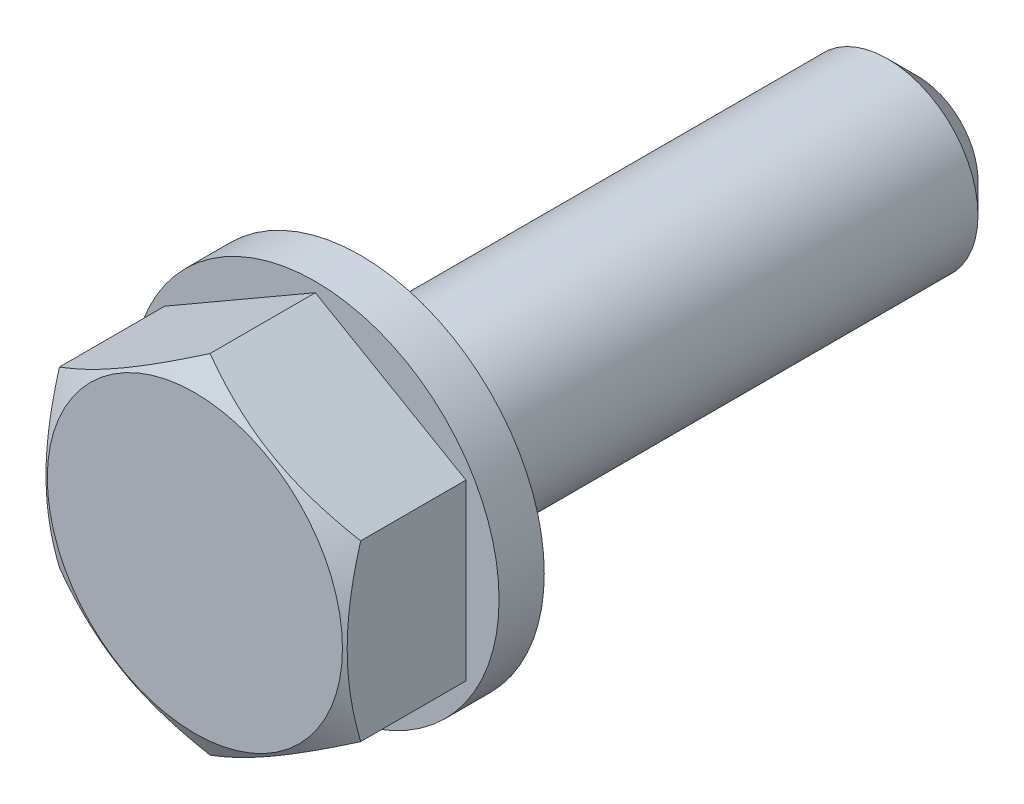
ISO-10303-21;
HEADER;
FILE_DESCRIPTION(('STEP AP214'),'2;1');
FILE_NAME('part.step','',(''),(''),'','','');
FILE_SCHEMA(('AUTOMOTIVE_DESIGN { 1 0 10303 214 1 1 1 1 }'));
ENDSEC;
DATA;
#1=APPLICATION_CONTEXT('core data for automotive mechanical design processes');
#2=APPLICATION_PROTOCOL_DEFINITION('international standard','automotive_design',2000,#1);
#3=PRODUCT_CONTEXT('',#1,'mechanical');
#4=PRODUCT('Part','Part','',(#3));
#5=PRODUCT_RELATED_PRODUCT_CATEGORY('part','',(#4));
#6=PRODUCT_DEFINITION_FORMATION('','',#4);
#7=PRODUCT_DEFINITION_CONTEXT('part definition',#1,'design');
#8=PRODUCT_DEFINITION('design','',#6,#7);
#9=PRODUCT_DEFINITION_SHAPE('','',#8);
#10=(LENGTH_UNIT() NAMED_UNIT(*) SI_UNIT(.MILLI.,.METRE.));
#11=(NAMED_UNIT(*) PLANE_ANGLE_UNIT() SI_UNIT($,.RADIAN.));
#12=(NAMED_UNIT(*) SI_UNIT($,.STERADIAN.) SOLID_ANGLE_UNIT());
#13=UNCERTAINTY_MEASURE_WITH_UNIT(LENGTH_MEASURE(1.E-05),#10,'distance_accuracy_value','');
#14=(GEOMETRIC_REPRESENTATION_CONTEXT(3) GLOBAL_UNCERTAINTY_ASSIGNED_CONTEXT((#13)) GLOBAL_UNIT_ASSIGNED_CONTEXT((#10,
#11,#12)) REPRESENTATION_CONTEXT('',''));
#15=CARTESIAN_POINT('',(0.,0.,0.));
#16=DIRECTION('',(0.,0.,1.));
#17=DIRECTION('',(1.,0.,0.));
#18=AXIS2_PLACEMENT_3D('',#15,#16,#17);
#19=CARTESIAN_POINT('',(0.,5.77350269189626,0.));
#20=DIRECTION('',(0.,0.,1.));
#21=DIRECTION('',(1.,0.,0.));
#22=AXIS2_PLACEMENT_3D('',#19,#20,#21);
#23=PLANE('',#22);
#24=CARTESIAN_POINT('',(0.,0.,0.));
#25=DIRECTION('',(0.,0.,-1.));
#26=DIRECTION('',(-1.,0.,0.));
#27=AXIS2_PLACEMENT_3D('',#24,#25,#26);
#28=CIRCLE('',#27,3.05);
#29=CARTESIAN_POINT('',(-3.05,0.,0.));
#30=VERTEX_POINT('',#29);
#31=EDGE_CURVE('E338',#30,#30,#28,.T.);
#32=ORIENTED_EDGE('',*,*,#31,.T.);
#33=EDGE_LOOP('',(#32));
#34=FACE_BOUND('',#33,.T.);
#35=CARTESIAN_POINT('',(0.,0.,0.));
#36=DIRECTION('',(0.,0.,1.));
#37=DIRECTION('',(1.,0.,0.));
#38=AXIS2_PLACEMENT_3D('',#35,#36,#37);
#39=CIRCLE('',#38,3.);
#40=CARTESIAN_POINT('',(3.,0.,0.));
#41=VERTEX_POINT('',#40);
#42=EDGE_CURVE('E102',#41,#41,#39,.F.);
#43=ORIENTED_EDGE('',*,*,#42,.F.);
#44=EDGE_LOOP('',(#43));
#45=FACE_BOUND('',#44,.T.);
#46=ADVANCED_FACE('F14',(#34,#45),#23,.F.);
#47=CARTESIAN_POINT('',(0.,0.,-20.));
#48=DIRECTION('',(0.,0.,1.));
#49=DIRECTION('',(1.,0.,0.));
#50=AXIS2_PLACEMENT_3D('',#47,#48,#49);
#51=CYLINDRICAL_SURFACE('',#50,3.);
#52=CARTESIAN_POINT('',(0.,0.,-19.));
#53=DIRECTION('',(0.,0.,-1.));
#54=DIRECTION('',(-1.,0.,0.));
#55=AXIS2_PLACEMENT_3D('',#52,#53,#54);
#56=CIRCLE('',#55,3.);
#57=CARTESIAN_POINT('',(-3.,0.,-19.));
#58=VERTEX_POINT('',#57);
#59=EDGE_CURVE('E9',#58,#58,#56,.F.);
#60=ORIENTED_EDGE('',*,*,#59,.T.);
#61=EDGE_LOOP('',(#60));
#62=FACE_BOUND('',#61,.T.);
#63=ORIENTED_EDGE('',*,*,#42,.T.);
#64=EDGE_LOOP('',(#63));
#65=FACE_BOUND('',#64,.T.);
#66=ADVANCED_FACE('F120',(#62,#65),#51,.T.);
#67=CARTESIAN_POINT('',(0.,0.,-20.));
#68=DIRECTION('',(0.,0.,-1.));
#69=DIRECTION('',(-1.,0.,0.));
#70=AXIS2_PLACEMENT_3D('',#67,#68,#69);
#71=PLANE('',#70);
#72=CARTESIAN_POINT('',(0.,0.,-20.));
#73=DIRECTION('',(0.,0.,-1.));
#74=DIRECTION('',(-1.,0.,0.));
#75=AXIS2_PLACEMENT_3D('',#72,#73,#74);
#76=CIRCLE('',#75,2.);
#77=CARTESIAN_POINT('',(-2.,0.,-20.));
#78=VERTEX_POINT('',#77);
#79=EDGE_CURVE('E22',#78,#78,#76,.T.);
#80=ORIENTED_EDGE('',*,*,#79,.T.);
#81=EDGE_LOOP('',(#80));
#82=FACE_BOUND('',#81,.T.);
#83=ADVANCED_FACE('F107',(#82),#71,.T.);
#84=CARTESIAN_POINT('',(0.,0.,-20.));
#85=DIRECTION('',(0.,0.,1.));
#86=DIRECTION('',(1.,0.,0.));
#87=AXIS2_PLACEMENT_3D('',#84,#85,#86);
#88=CONICAL_SURFACE('',#87,2.,0.785398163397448);
#89=ORIENTED_EDGE('',*,*,#59,.F.);
#90=EDGE_LOOP('',(#89));
#91=FACE_BOUND('',#90,.T.);
#92=ORIENTED_EDGE('',*,*,#79,.F.);
#93=EDGE_LOOP('',(#92));
#94=FACE_BOUND('',#93,.T.);
#95=ADVANCED_FACE('F16',(#91,#94),#88,.T.);
#96=CARTESIAN_POINT('',(0.,0.,0.));
#97=DIRECTION('',(0.,0.,-1.));
#98=DIRECTION('',(-1.,0.,0.));
#99=AXIS2_PLACEMENT_3D('',#96,#97,#98);
#100=PLANE('',#99);
#101=CARTESIAN_POINT('',(0.,0.,0.));
#102=DIRECTION('',(0.,0.,-1.));
#103=DIRECTION('',(-1.,0.,0.));
#104=AXIS2_PLACEMENT_3D('',#101,#102,#103);
#105=CIRCLE('',#104,6.1);
#106=CARTESIAN_POINT('',(-6.1,0.,0.));
#107=VERTEX_POINT('',#106);
#108=EDGE_CURVE('E337',#107,#107,#105,.T.);
#109=ORIENTED_EDGE('',*,*,#108,.F.);
#110=EDGE_LOOP('',(#109));
#111=FACE_BOUND('',#110,.T.);
#112=DIRECTION('',(-0.866025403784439,-0.5,0.));
#113=VECTOR('',#112,1.);
#114=CARTESIAN_POINT('',(0.,5.77350269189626,0.));
#115=LINE('',#114,#113);
#116=CARTESIAN_POINT('',(0.,5.77350269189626,0.));
#117=VERTEX_POINT('',#116);
#118=CARTESIAN_POINT('',(-5.,2.88675134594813,0.));
#119=VERTEX_POINT('',#118);
#120=EDGE_CURVE('E210',#117,#119,#115,.T.);
#121=ORIENTED_EDGE('',*,*,#120,.F.);
#122=DIRECTION('',(-0.866025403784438,0.5,0.));
#123=VECTOR('',#122,1.);
#124=CARTESIAN_POINT('',(5.,2.88675134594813,0.));
#125=LINE('',#124,#123);
#126=CARTESIAN_POINT('',(5.,2.88675134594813,0.));
#127=VERTEX_POINT('',#126);
#128=EDGE_CURVE('E37',#127,#117,#125,.T.);
#129=ORIENTED_EDGE('',*,*,#128,.F.);
#130=DIRECTION('',(0.,1.,0.));
#131=VECTOR('',#130,1.);
#132=CARTESIAN_POINT('',(5.,-2.88675134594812,0.));
#133=LINE('',#132,#131);
#134=CARTESIAN_POINT('',(5.,-2.88675134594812,0.));
#135=VERTEX_POINT('',#134);
#136=EDGE_CURVE('E65',#135,#127,#133,.T.);
#137=ORIENTED_EDGE('',*,*,#136,.F.);
#138=DIRECTION('',(0.866025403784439,0.5,0.));
#139=VECTOR('',#138,1.);
#140=CARTESIAN_POINT('',(0.,-5.77350269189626,0.));
#141=LINE('',#140,#139);
#142=CARTESIAN_POINT('',(0.,-5.77350269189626,0.));
#143=VERTEX_POINT('',#142);
#144=EDGE_CURVE('E69',#143,#135,#141,.T.);
#145=ORIENTED_EDGE('',*,*,#144,.F.);
#146=DIRECTION('',(0.866025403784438,-0.5,0.));
#147=VECTOR('',#146,1.);
#148=CARTESIAN_POINT('',(-5.,-2.88675134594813,0.));
#149=LINE('',#148,#147);
#150=CARTESIAN_POINT('',(-5.,-2.88675134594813,0.));
#151=VERTEX_POINT('',#150);
#152=EDGE_CURVE('E85',#151,#143,#149,.T.);
#153=ORIENTED_EDGE('',*,*,#152,.F.);
#154=DIRECTION('',(0.,-1.,0.));
#155=VECTOR('',#154,1.);
#156=CARTESIAN_POINT('',(-5.,2.88675134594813,0.));
#157=LINE('',#156,#155);
#158=EDGE_CURVE('E87',#119,#151,#157,.T.);
#159=ORIENTED_EDGE('',*,*,#158,.F.);
#160=EDGE_LOOP('',(#121,#129,#137,#145,#153,#159));
#161=FACE_BOUND('',#160,.T.);
#162=ADVANCED_FACE('F67',(#111,#161),#100,.F.);
#163=CARTESIAN_POINT('',(0.,0.,-1.5));
#164=DIRECTION('',(0.,0.,-1.));
#165=DIRECTION('',(-1.,0.,0.));
#166=AXIS2_PLACEMENT_3D('',#163,#164,#165);
#167=PLANE('',#166);
#168=CARTESIAN_POINT('',(0.,0.,-1.5));
#169=DIRECTION('',(0.,0.,-1.));
#170=DIRECTION('',(-1.,0.,0.));
#171=AXIS2_PLACEMENT_3D('',#168,#169,#170);
#172=CIRCLE('',#171,6.1);
#173=CARTESIAN_POINT('',(-6.1,0.,-1.5));
#174=VERTEX_POINT('',#173);
#175=EDGE_CURVE('E333',#174,#174,#172,.T.);
#176=ORIENTED_EDGE('',*,*,#175,.T.);
#177=EDGE_LOOP('',(#176));
#178=FACE_BOUND('',#177,.T.);
#179=CARTESIAN_POINT('',(0.,0.,-1.5));
#180=DIRECTION('',(0.,0.,-1.));
#181=DIRECTION('',(-1.,0.,0.));
#182=AXIS2_PLACEMENT_3D('',#179,#180,#181);
#183=CIRCLE('',#182,3.05);
#184=CARTESIAN_POINT('',(-3.05,0.,-1.5));
#185=VERTEX_POINT('',#184);
#186=EDGE_CURVE('E336',#185,#185,#183,.T.);
#187=ORIENTED_EDGE('',*,*,#186,.F.);
#188=EDGE_LOOP('',(#187));
#189=FACE_BOUND('',#188,.T.);
#190=ADVANCED_FACE('F117',(#178,#189),#167,.T.);
#191=CARTESIAN_POINT('',(0.,0.,-1.5));
#192=DIRECTION('',(0.,0.,1.));
#193=DIRECTION('',(1.,0.,0.));
#194=AXIS2_PLACEMENT_3D('',#191,#192,#193);
#195=CYLINDRICAL_SURFACE('',#194,6.1);
#196=ORIENTED_EDGE('',*,*,#175,.F.);
#197=EDGE_LOOP('',(#196));
#198=FACE_BOUND('',#197,.T.);
#199=ORIENTED_EDGE('',*,*,#108,.T.);
#200=EDGE_LOOP('',(#199));
#201=FACE_BOUND('',#200,.T.);
#202=ADVANCED_FACE('F260',(#198,#201),#195,.T.);
#203=CARTESIAN_POINT('',(0.,0.,-1.5));
#204=DIRECTION('',(0.,0.,1.));
#205=DIRECTION('',(1.,0.,0.));
#206=AXIS2_PLACEMENT_3D('',#203,#204,#205);
#207=CYLINDRICAL_SURFACE('',#206,3.05);
#208=ORIENTED_EDGE('',*,*,#186,.T.);
#209=EDGE_LOOP('',(#208));
#210=FACE_BOUND('',#209,.T.);
#211=ORIENTED_EDGE('',*,*,#31,.F.);
#212=EDGE_LOOP('',(#211));
#213=FACE_BOUND('',#212,.T.);
#214=ADVANCED_FACE('F252',(#210,#213),#207,.F.);
#215=CARTESIAN_POINT('',(0.,5.77350269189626,4.));
#216=DIRECTION('',(0.,0.,1.));
#217=DIRECTION('',(1.,0.,0.));
#218=AXIS2_PLACEMENT_3D('',#215,#216,#217);
#219=PLANE('',#218);
#220=CARTESIAN_POINT('',(0.,0.,4.));
#221=DIRECTION('',(0.,0.,-1.));
#222=DIRECTION('',(-1.,0.,0.));
#223=AXIS2_PLACEMENT_3D('',#220,#221,#222);
#224=CIRCLE('',#223,4.9);
#225=CARTESIAN_POINT('',(-4.9,0.,4.));
#226=VERTEX_POINT('',#225);
#227=EDGE_CURVE('E151',#226,#226,#224,.T.);
#228=ORIENTED_EDGE('',*,*,#227,.F.);
#229=EDGE_LOOP('',(#228));
#230=FACE_BOUND('',#229,.T.);
#231=ADVANCED_FACE('F136',(#230),#219,.T.);
#232=CARTESIAN_POINT('',(0.,0.,4.));
#233=DIRECTION('',(0.,0.,-1.));
#234=DIRECTION('',(-1.,0.,0.));
#235=AXIS2_PLACEMENT_3D('',#232,#233,#234);
#236=CONICAL_SURFACE('',#235,4.9,1.0471975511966);
#237=ORIENTED_EDGE('',*,*,#227,.T.);
#238=EDGE_LOOP('',(#237));
#239=FACE_BOUND('',#238,.T.);
#240=CARTESIAN_POINT('',(-5.0002,2.88663587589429,3.49561631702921));
#241=CARTESIAN_POINT('',(-4.78046540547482,3.01349970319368,3.5688784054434));
#242=CARTESIAN_POINT('',(-4.55885141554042,3.14144859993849,3.63551365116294));
#243=CARTESIAN_POINT('',(-4.11178600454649,3.39956193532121,3.75182598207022));
#244=CARTESIAN_POINT('',(-3.88632664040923,3.52973095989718,3.80146192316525));
#245=CARTESIAN_POINT('',(-3.43816769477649,3.78847564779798,3.87871394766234));
#246=CARTESIAN_POINT('',(-3.21553790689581,3.91701101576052,3.90684459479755));
#247=CARTESIAN_POINT('',(-2.88081009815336,4.11026620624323,3.93207005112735));
#248=CARTESIAN_POINT('',(-2.76915780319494,4.17472868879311,3.93765151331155));
#249=CARTESIAN_POINT('',(-2.54575002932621,4.30371322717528,3.94306275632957));
#250=CARTESIAN_POINT('',(-2.43399455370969,4.36823528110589,3.94289271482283));
#251=CARTESIAN_POINT('',(-2.12781576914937,4.54500768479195,3.934511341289));
#252=CARTESIAN_POINT('',(-1.93349391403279,4.65719946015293,3.92043520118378));
#253=CARTESIAN_POINT('',(-1.5461398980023,4.88083840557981,3.8757997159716));
#254=CARTESIAN_POINT('',(-1.35310909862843,4.9922847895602,3.84522511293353));
#255=CARTESIAN_POINT('',(-0.96497465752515,5.21637431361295,3.76879647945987));
#256=CARTESIAN_POINT('',(-0.769920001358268,5.32898917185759,3.72261859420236));
#257=CARTESIAN_POINT('',(-0.382719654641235,5.55253939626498,3.6178131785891));
#258=CARTESIAN_POINT('',(-0.190569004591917,5.66347762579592,3.55921026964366));
#259=CARTESIAN_POINT('',(0.000199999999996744,5.7736181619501,3.49561631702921));
#260=B_SPLINE_CURVE_WITH_KNOTS('',3,(#240,#241,#242,#243,#244,#245,#246,#247,#248,#249,#250,
#251,#252,#253,#254,#255,#256,#257,#258,#259),.UNSPECIFIED.,.F.,.F.,(4,2,2,2,2,2,2,2,2,4),(0.,
0.792555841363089,1.58701660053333,2.3618153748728,2.74884076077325,3.13585419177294,
3.80962362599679,4.48401723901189,5.17336882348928,5.86136694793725),.UNSPECIFIED.);
#261=CARTESIAN_POINT('',(-5.,2.88675134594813,3.49568298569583));
#262=VERTEX_POINT('',#261);
#263=CARTESIAN_POINT('',(0.,5.77350269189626,3.49568298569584));
#264=VERTEX_POINT('',#263);
#265=EDGE_CURVE('E180',#262,#264,#260,.T.);
#266=ORIENTED_EDGE('',*,*,#265,.F.);
#267=CARTESIAN_POINT('',(-5.,-7.710520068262,1.52329237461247));
#268=CARTESIAN_POINT('',(-5.,-7.49250008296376,1.62887535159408));
#269=CARTESIAN_POINT('',(-5.,-7.27397489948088,1.73343324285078));
#270=CARTESIAN_POINT('',(-5.,-6.83564530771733,1.93992142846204));
#271=CARTESIAN_POINT('',(-5.,-6.61584070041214,2.04185129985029));
#272=CARTESIAN_POINT('',(-5.,-6.17352983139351,2.24302821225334));
#273=CARTESIAN_POINT('',(-5.,-5.95101534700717,2.3422572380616));
#274=CARTESIAN_POINT('',(-5.,-5.50420121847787,2.5365957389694));
#275=CARTESIAN_POINT('',(-5.,-5.27990166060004,2.63170541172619));
#276=CARTESIAN_POINT('',(-5.,-4.82208977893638,2.81961847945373));
#277=CARTESIAN_POINT('',(-5.,-4.58850905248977,2.91225614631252));
#278=CARTESIAN_POINT('',(-5.,-4.11859872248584,3.09041397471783));
#279=CARTESIAN_POINT('',(-5.,-3.8822688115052,3.17593333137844));
#280=CARTESIAN_POINT('',(-5.,-3.40694086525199,3.3375774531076));
#281=CARTESIAN_POINT('',(-5.,-3.1679494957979,3.41372162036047));
#282=CARTESIAN_POINT('',(-5.,-2.68653906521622,3.55414319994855));
#283=CARTESIAN_POINT('',(-5.,-2.44412112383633,3.61842439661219));
#284=CARTESIAN_POINT('',(-5.,-1.95705791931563,3.73166682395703));
#285=CARTESIAN_POINT('',(-5.,-1.71243195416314,3.78070951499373));
#286=CARTESIAN_POINT('',(-5.,-1.22018417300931,3.86067296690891));
#287=CARTESIAN_POINT('',(-5.,-0.97256262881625,3.89159535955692));
#288=CARTESIAN_POINT('',(-5.,-0.478776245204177,3.93244571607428));
#289=CARTESIAN_POINT('',(-5.,-0.232634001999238,3.9426401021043));
#290=CARTESIAN_POINT('',(-5.,0.259635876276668,3.9418687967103));
#291=CARTESIAN_POINT('',(-5.,0.505763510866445,3.93090260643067));
#292=CARTESIAN_POINT('',(-5.,0.924924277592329,3.89497733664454));
#293=CARTESIAN_POINT('',(-5.,1.09841032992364,3.8750116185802));
#294=CARTESIAN_POINT('',(-5.,1.44407602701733,3.8258338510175));
#295=CARTESIAN_POINT('',(-5.,1.61625548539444,3.79662050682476));
#296=CARTESIAN_POINT('',(-5.,2.13062542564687,3.69664838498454));
#297=CARTESIAN_POINT('',(-5.,2.47044753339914,3.61357689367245));
#298=CARTESIAN_POINT('',(-5.,2.97851264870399,3.46999451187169));
#299=CARTESIAN_POINT('',(-5.,3.14940098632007,3.41831498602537));
#300=CARTESIAN_POINT('',(-5.,3.48951680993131,3.30970491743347));
#301=CARTESIAN_POINT('',(-5.,3.65874428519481,3.25277434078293));
#302=CARTESIAN_POINT('',(-5.,3.99559425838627,3.13456602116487));
#303=CARTESIAN_POINT('',(-5.,4.16321729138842,3.07328978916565));
#304=CARTESIAN_POINT('',(-5.,4.4970825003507,2.94709939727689));
#305=CARTESIAN_POINT('',(-5.,4.66332469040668,2.88218527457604));
#306=CARTESIAN_POINT('',(-5.,5.0468902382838,2.72834580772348));
#307=CARTESIAN_POINT('',(-5.,5.2637677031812,2.63831096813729));
#308=CARTESIAN_POINT('',(-5.,5.69574960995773,2.45407283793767));
#309=CARTESIAN_POINT('',(-5.,5.91085395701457,2.35986932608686));
#310=CARTESIAN_POINT('',(-5.,6.33960523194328,2.16810763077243));
#311=CARTESIAN_POINT('',(-5.,6.55325188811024,2.07054884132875));
#312=CARTESIAN_POINT('',(-5.,6.97928985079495,1.87272379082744));
#313=CARTESIAN_POINT('',(-5.,7.19168113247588,1.77245747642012));
#314=CARTESIAN_POINT('',(-5.,7.82766492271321,1.4681803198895));
#315=CARTESIAN_POINT('',(-5.,8.24967706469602,1.26086815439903));
#316=CARTESIAN_POINT('',(-5.,9.09069164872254,0.840227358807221));
#317=CARTESIAN_POINT('',(-5.,9.50969398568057,0.626898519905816));
#318=CARTESIAN_POINT('',(-5.,10.1197143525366,0.312339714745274));
#319=CARTESIAN_POINT('',(-5.,10.3116116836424,0.21280999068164));
#320=CARTESIAN_POINT('',(-5.,10.6949886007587,0.0129573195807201));
#321=CARTESIAN_POINT('',(-5.,10.886468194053,-0.0873656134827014));
#322=CARTESIAN_POINT('',(-5.,11.4603788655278,-0.389373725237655));
#323=CARTESIAN_POINT('',(-5.,11.8422670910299,-0.592090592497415));
#324=CARTESIAN_POINT('',(-5.,12.6040312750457,-0.999155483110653));
#325=CARTESIAN_POINT('',(-5.,12.9839098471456,-1.20349862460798));
#326=CARTESIAN_POINT('',(-5.,13.7427444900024,-1.61384482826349));
#327=CARTESIAN_POINT('',(-5.,14.1217006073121,-1.81984780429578));
#328=CARTESIAN_POINT('',(-5.,14.5003145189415,-2.02647390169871));
#329=B_SPLINE_CURVE_WITH_KNOTS('',3,(#267,#268,#269,#270,#271,#272,#273,#274,#275,#276,#277,
#278,#279,#280,#281,#282,#283,#284,#285,#286,#287,#288,#289,#290,#291,#292,#293,#294,#295,#296,
#297,#298,#299,#300,#301,#302,#303,#304,#305,#306,#307,#308,#309,#310,#311,#312,#313,#314,#315,
#316,#317,#318,#319,#320,#321,#322,#323,#324,#325,#326,#327,#328),.UNSPECIFIED.,.F.,.F.,(4,2,2,
2,2,2,2,2,2,2,2,2,2,2,2,2,2,2,2,2,2,2,2,2,2,2,2,2,2,2,4),(0.,0.726730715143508,1.45357767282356,
2.18445592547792,2.91529906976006,3.66904976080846,4.42288556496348,5.17513408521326,
5.92714221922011,6.67505829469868,7.42290700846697,8.16108107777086,8.89927254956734,
9.4229111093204,9.94662301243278,10.9946467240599,11.5301982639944,12.0657532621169,
12.6011229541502,13.1364871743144,13.840900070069,14.545350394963,15.2499286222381,
15.9545207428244,17.3649902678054,18.7755088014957,19.4240261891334,20.0725321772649,
21.3695939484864,22.6636432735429,23.9576258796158),.UNSPECIFIED.);
#330=CARTESIAN_POINT('',(-5.,-2.88675134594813,3.49568298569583));
#331=VERTEX_POINT('',#330);
#332=EDGE_CURVE('E173',#331,#262,#329,.T.);
#333=ORIENTED_EDGE('',*,*,#332,.F.);
#334=CARTESIAN_POINT('',(0.000199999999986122,-5.7736181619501,3.49561631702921));
#335=CARTESIAN_POINT('',(-0.219534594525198,-5.64675433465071,3.56887840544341));
#336=CARTESIAN_POINT('',(-0.441148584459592,-5.51880543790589,3.63551365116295));
#337=CARTESIAN_POINT('',(-0.888213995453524,-5.26069210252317,3.75182598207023));
#338=CARTESIAN_POINT('',(-1.11367335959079,-5.13052307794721,3.80146192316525));
#339=CARTESIAN_POINT('',(-1.56183230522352,-4.87177839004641,3.87871394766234));
#340=CARTESIAN_POINT('',(-1.7844620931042,-4.74324302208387,3.90684459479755));
#341=CARTESIAN_POINT('',(-2.11918990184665,-4.54998783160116,3.93207005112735));
#342=CARTESIAN_POINT('',(-2.23084219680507,-4.48552534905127,3.93765151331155));
#343=CARTESIAN_POINT('',(-2.45424997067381,-4.35654081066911,3.94306275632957));
#344=CARTESIAN_POINT('',(-2.56600544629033,-4.2920187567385,3.94289271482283));
#345=CARTESIAN_POINT('',(-2.87218423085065,-4.11524635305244,3.934511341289));
#346=CARTESIAN_POINT('',(-3.06650608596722,-4.00305457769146,3.92043520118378));
#347=CARTESIAN_POINT('',(-3.45386010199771,-3.77941563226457,3.8757997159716));
#348=CARTESIAN_POINT('',(-3.64689090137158,-3.66796924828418,3.84522511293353));
#349=CARTESIAN_POINT('',(-4.03502534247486,-3.44387972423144,3.76879647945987));
#350=CARTESIAN_POINT('',(-4.23007999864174,-3.3312648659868,3.72261859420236));
#351=CARTESIAN_POINT('',(-4.61728034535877,-3.1077146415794,3.6178131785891));
#352=CARTESIAN_POINT('',(-4.80943099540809,-2.99677641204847,3.55921026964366));
#353=CARTESIAN_POINT('',(-5.0002,-2.88663587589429,3.49561631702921));
#354=B_SPLINE_CURVE_WITH_KNOTS('',3,(#334,#335,#336,#337,#338,#339,#340,#341,#342,#343,#344,
#345,#346,#347,#348,#349,#350,#351,#352,#353),.UNSPECIFIED.,.F.,.F.,(4,2,2,2,2,2,2,2,2,4),(0.,
0.792555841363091,1.58701660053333,2.36181537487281,2.74884076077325,3.13585419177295,
3.80962362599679,4.48401723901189,5.17336882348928,5.86136694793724),.UNSPECIFIED.);
#355=CARTESIAN_POINT('',(0.,-5.77350269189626,3.49568298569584));
#356=VERTEX_POINT('',#355);
#357=EDGE_CURVE('E167',#356,#331,#354,.T.);
#358=ORIENTED_EDGE('',*,*,#357,.F.);
#359=CARTESIAN_POINT('',(5.0002,-2.88663587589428,3.49561631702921));
#360=CARTESIAN_POINT('',(4.78046540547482,-3.01349970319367,3.56887840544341));
#361=CARTESIAN_POINT('',(4.55885141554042,-3.14144859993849,3.63551365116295));
#362=CARTESIAN_POINT('',(4.11178600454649,-3.3995619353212,3.75182598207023));
#363=CARTESIAN_POINT('',(3.88632664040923,-3.52973095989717,3.80146192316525));
#364=CARTESIAN_POINT('',(3.43816769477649,-3.78847564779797,3.87871394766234));
#365=CARTESIAN_POINT('',(3.21553790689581,-3.91701101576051,3.90684459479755));
#366=CARTESIAN_POINT('',(2.88081009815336,-4.11026620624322,3.93207005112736));
#367=CARTESIAN_POINT('',(2.76915780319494,-4.1747286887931,3.93765151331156));
#368=CARTESIAN_POINT('',(2.5457500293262,-4.30371322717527,3.94306275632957));
#369=CARTESIAN_POINT('',(2.43399455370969,-4.36823528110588,3.94289271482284));
#370=CARTESIAN_POINT('',(2.12781576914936,-4.54500768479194,3.93451134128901));
#371=CARTESIAN_POINT('',(1.93349391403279,-4.65719946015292,3.92043520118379));
#372=CARTESIAN_POINT('',(1.54613989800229,-4.88083840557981,3.87579971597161));
#373=CARTESIAN_POINT('',(1.35310909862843,-4.9922847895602,3.84522511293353));
#374=CARTESIAN_POINT('',(0.964974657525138,-5.21637431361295,3.76879647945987));
#375=CARTESIAN_POINT('',(0.769920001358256,-5.32898917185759,3.72261859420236));
#376=CARTESIAN_POINT('',(0.38271965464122,-5.55253939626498,3.6178131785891));
#377=CARTESIAN_POINT('',(0.190569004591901,-5.66347762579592,3.55921026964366));
#378=CARTESIAN_POINT('',(-0.000200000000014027,-5.7736181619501,3.49561631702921));
#379=B_SPLINE_CURVE_WITH_KNOTS('',3,(#359,#360,#361,#362,#363,#364,#365,#366,#367,#368,#369,
#370,#371,#372,#373,#374,#375,#376,#377,#378),.UNSPECIFIED.,.F.,.F.,(4,2,2,2,2,2,2,2,2,4),(0.,
0.79255584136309,1.58701660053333,2.3618153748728,2.74884076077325,3.13585419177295,
3.80962362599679,4.4840172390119,5.1733688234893,5.86136694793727),.UNSPECIFIED.);
#380=CARTESIAN_POINT('',(5.,-2.88675134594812,3.49568298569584));
#381=VERTEX_POINT('',#380);
#382=EDGE_CURVE('E29',#381,#356,#379,.T.);
#383=ORIENTED_EDGE('',*,*,#382,.F.);
#384=CARTESIAN_POINT('',(5.,-7.71052006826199,1.52329237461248));
#385=CARTESIAN_POINT('',(5.,-7.49250008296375,1.62887535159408));
#386=CARTESIAN_POINT('',(5.,-7.27397489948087,1.73343324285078));
#387=CARTESIAN_POINT('',(5.,-6.83564530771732,1.93992142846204));
#388=CARTESIAN_POINT('',(5.,-6.61584070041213,2.0418512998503));
#389=CARTESIAN_POINT('',(5.,-6.1735298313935,2.24302821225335));
#390=CARTESIAN_POINT('',(5.,-5.95101534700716,2.3422572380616));
#391=CARTESIAN_POINT('',(5.,-5.50420121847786,2.5365957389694));
#392=CARTESIAN_POINT('',(5.,-5.27990166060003,2.63170541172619));
#393=CARTESIAN_POINT('',(5.,-4.82208977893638,2.81961847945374));
#394=CARTESIAN_POINT('',(5.,-4.58850905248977,2.91225614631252));
#395=CARTESIAN_POINT('',(5.,-4.11859872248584,3.09041397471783));
#396=CARTESIAN_POINT('',(5.,-3.88226881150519,3.17593333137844));
#397=CARTESIAN_POINT('',(5.,-3.40694086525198,3.3375774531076));
#398=CARTESIAN_POINT('',(5.,-3.16794949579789,3.41372162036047));
#399=CARTESIAN_POINT('',(5.,-2.68653906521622,3.55414319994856));
#400=CARTESIAN_POINT('',(5.,-2.44412112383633,3.61842439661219));
#401=CARTESIAN_POINT('',(5.,-1.95705791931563,3.73166682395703));
#402=CARTESIAN_POINT('',(5.,-1.71243195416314,3.78070951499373));
#403=CARTESIAN_POINT('',(5.,-1.22018417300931,3.86067296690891));
#404=CARTESIAN_POINT('',(5.,-0.972562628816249,3.89159535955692));
#405=CARTESIAN_POINT('',(5.,-0.478776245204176,3.93244571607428));
#406=CARTESIAN_POINT('',(5.,-0.232634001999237,3.9426401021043));
#407=CARTESIAN_POINT('',(5.,0.259635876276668,3.9418687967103));
#408=CARTESIAN_POINT('',(5.,0.505763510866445,3.93090260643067));
#409=CARTESIAN_POINT('',(5.,0.924924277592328,3.89497733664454));
#410=CARTESIAN_POINT('',(5.,1.09841032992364,3.8750116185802));
#411=CARTESIAN_POINT('',(5.,1.44407602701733,3.8258338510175));
#412=CARTESIAN_POINT('',(5.,1.61625548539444,3.79662050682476));
#413=CARTESIAN_POINT('',(5.,2.13062542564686,3.69664838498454));
#414=CARTESIAN_POINT('',(5.,2.47044753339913,3.61357689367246));
#415=CARTESIAN_POINT('',(5.,2.97851264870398,3.46999451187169));
#416=CARTESIAN_POINT('',(5.,3.14940098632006,3.41831498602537));
#417=CARTESIAN_POINT('',(5.,3.4895168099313,3.30970491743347));
#418=CARTESIAN_POINT('',(5.,3.6587442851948,3.25277434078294));
#419=CARTESIAN_POINT('',(5.,3.99559425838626,3.13456602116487));
#420=CARTESIAN_POINT('',(5.,4.16321729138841,3.07328978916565));
#421=CARTESIAN_POINT('',(5.,4.49708250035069,2.94709939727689));
#422=CARTESIAN_POINT('',(5.,4.66332469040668,2.88218527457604));
#423=CARTESIAN_POINT('',(5.,5.04689023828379,2.72834580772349));
#424=CARTESIAN_POINT('',(5.,5.26376770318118,2.6383109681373));
#425=CARTESIAN_POINT('',(5.,5.69574960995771,2.45407283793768));
#426=CARTESIAN_POINT('',(5.,5.91085395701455,2.35986932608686));
#427=CARTESIAN_POINT('',(5.,6.33960523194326,2.16810763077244));
#428=CARTESIAN_POINT('',(5.,6.55325188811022,2.07054884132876));
#429=CARTESIAN_POINT('',(5.,6.97928985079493,1.87272379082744));
#430=CARTESIAN_POINT('',(5.,7.19168113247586,1.77245747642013));
#431=CARTESIAN_POINT('',(5.,7.82766492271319,1.46818031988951));
#432=CARTESIAN_POINT('',(5.,8.249677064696,1.26086815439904));
#433=CARTESIAN_POINT('',(5.,9.09069164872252,0.840227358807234));
#434=CARTESIAN_POINT('',(5.,9.50969398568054,0.626898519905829));
#435=CARTESIAN_POINT('',(5.,10.1197143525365,0.312339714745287));
#436=CARTESIAN_POINT('',(5.,10.3116116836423,0.212809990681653));
#437=CARTESIAN_POINT('',(5.,10.6949886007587,0.0129573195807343));
#438=CARTESIAN_POINT('',(5.,10.8864681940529,-0.0873656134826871));
#439=CARTESIAN_POINT('',(5.,11.4603788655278,-0.389373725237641));
#440=CARTESIAN_POINT('',(5.,11.8422670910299,-0.592090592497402));
#441=CARTESIAN_POINT('',(5.,12.6040312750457,-0.999155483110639));
#442=CARTESIAN_POINT('',(5.,12.9839098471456,-1.20349862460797));
#443=CARTESIAN_POINT('',(5.,13.7427444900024,-1.61384482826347));
#444=CARTESIAN_POINT('',(5.,14.121700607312,-1.81984780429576));
#445=CARTESIAN_POINT('',(5.,14.5003145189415,-2.0264739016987));
#446=B_SPLINE_CURVE_WITH_KNOTS('',3,(#384,#385,#386,#387,#388,#389,#390,#391,#392,#393,#394,
#395,#396,#397,#398,#399,#400,#401,#402,#403,#404,#405,#406,#407,#408,#409,#410,#411,#412,#413,
#414,#415,#416,#417,#418,#419,#420,#421,#422,#423,#424,#425,#426,#427,#428,#429,#430,#431,#432,
#433,#434,#435,#436,#437,#438,#439,#440,#441,#442,#443,#444,#445),.UNSPECIFIED.,.F.,.F.,(4,2,2,
2,2,2,2,2,2,2,2,2,2,2,2,2,2,2,2,2,2,2,2,2,2,2,2,2,2,2,4),(0.,0.726730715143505,1.45357767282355,
2.18445592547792,2.91529906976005,3.66904976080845,4.42288556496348,5.17513408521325,
5.9271422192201,6.67505829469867,7.42290700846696,8.16108107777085,8.89927254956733,
9.42291110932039,9.94662301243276,10.9946467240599,11.5301982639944,12.0657532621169,
12.6011229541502,13.1364871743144,13.840900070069,14.545350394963,15.249928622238,
15.9545207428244,17.3649902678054,18.7755088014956,19.4240261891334,20.0725321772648,
21.3695939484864,22.6636432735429,23.9576258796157),.UNSPECIFIED.);
#447=CARTESIAN_POINT('',(5.,2.88675134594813,3.49568298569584));
#448=VERTEX_POINT('',#447);
#449=EDGE_CURVE('E78',#448,#381,#446,.F.);
#450=ORIENTED_EDGE('',*,*,#449,.F.);
#451=CARTESIAN_POINT('',(-0.000200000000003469,5.7736181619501,3.49561631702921));
#452=CARTESIAN_POINT('',(0.219534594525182,5.64675433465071,3.5688784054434));
#453=CARTESIAN_POINT('',(0.441148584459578,5.5188054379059,3.63551365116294));
#454=CARTESIAN_POINT('',(0.888213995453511,5.26069210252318,3.75182598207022));
#455=CARTESIAN_POINT('',(1.11367335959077,5.13052307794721,3.80146192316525));
#456=CARTESIAN_POINT('',(1.56183230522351,4.87177839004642,3.87871394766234));
#457=CARTESIAN_POINT('',(1.78446209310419,4.74324302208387,3.90684459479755));
#458=CARTESIAN_POINT('',(2.11918990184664,4.54998783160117,3.93207005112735));
#459=CARTESIAN_POINT('',(2.23084219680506,4.48552534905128,3.93765151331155));
#460=CARTESIAN_POINT('',(2.45424997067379,4.35654081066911,3.94306275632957));
#461=CARTESIAN_POINT('',(2.56600544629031,4.2920187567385,3.94289271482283));
#462=CARTESIAN_POINT('',(2.87218423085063,4.11524635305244,3.934511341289));
#463=CARTESIAN_POINT('',(3.06650608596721,4.00305457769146,3.92043520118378));
#464=CARTESIAN_POINT('',(3.4538601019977,3.77941563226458,3.87579971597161));
#465=CARTESIAN_POINT('',(3.64689090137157,3.66796924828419,3.84522511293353));
#466=CARTESIAN_POINT('',(4.03502534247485,3.44387972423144,3.76879647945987));
#467=CARTESIAN_POINT('',(4.23007999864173,3.3312648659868,3.72261859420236));
#468=CARTESIAN_POINT('',(4.61728034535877,3.10771464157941,3.6178131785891));
#469=CARTESIAN_POINT('',(4.80943099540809,2.99677641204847,3.55921026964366));
#470=CARTESIAN_POINT('',(5.0002,2.88663587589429,3.49561631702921));
#471=B_SPLINE_CURVE_WITH_KNOTS('',3,(#451,#452,#453,#454,#455,#456,#457,#458,#459,#460,#461,
#462,#463,#464,#465,#466,#467,#468,#469,#470),.UNSPECIFIED.,.F.,.F.,(4,2,2,2,2,2,2,2,2,4),(0.,
0.79255584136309,1.58701660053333,2.3618153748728,2.74884076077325,3.13585419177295,
3.80962362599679,4.48401723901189,5.17336882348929,5.86136694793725),.UNSPECIFIED.);
#472=EDGE_CURVE('E187',#264,#448,#471,.T.);
#473=ORIENTED_EDGE('',*,*,#472,.F.);
#474=EDGE_LOOP('',(#266,#333,#358,#383,#450,#473));
#475=FACE_BOUND('',#474,.T.);
#476=ADVANCED_FACE('F141',(#239,#475),#236,.T.);
#477=CARTESIAN_POINT('',(5.,-2.88675134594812,4.));
#478=DIRECTION('',(-1.,0.,0.));
#479=DIRECTION('',(0.,0.,1.));
#480=AXIS2_PLACEMENT_3D('',#477,#478,#479);
#481=PLANE('',#480);
#482=DIRECTION('',(0.,0.,-1.));
#483=VECTOR('',#482,1.);
#484=CARTESIAN_POINT('',(5.,2.88675134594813,4.));
#485=LINE('',#484,#483);
#486=EDGE_CURVE('E73',#448,#127,#485,.T.);
#487=ORIENTED_EDGE('',*,*,#486,.F.);
#488=ORIENTED_EDGE('',*,*,#449,.T.);
#489=DIRECTION('',(0.,0.,-1.));
#490=VECTOR('',#489,1.);
#491=CARTESIAN_POINT('',(5.,-2.88675134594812,4.));
#492=LINE('',#491,#490);
#493=EDGE_CURVE('E76',#381,#135,#492,.T.);
#494=ORIENTED_EDGE('',*,*,#493,.T.);
#495=ORIENTED_EDGE('',*,*,#136,.T.);
#496=EDGE_LOOP('',(#487,#488,#494,#495));
#497=FACE_BOUND('',#496,.T.);
#498=ADVANCED_FACE('F77',(#497),#481,.F.);
#499=CARTESIAN_POINT('',(0.,-5.77350269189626,4.));
#500=DIRECTION('',(-0.5,0.866025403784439,0.));
#501=DIRECTION('',(-0.866025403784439,-0.5,0.));
#502=AXIS2_PLACEMENT_3D('',#499,#500,#501);
#503=PLANE('',#502);
#504=ORIENTED_EDGE('',*,*,#493,.F.);
#505=ORIENTED_EDGE('',*,*,#382,.T.);
#506=DIRECTION('',(0.,0.,-1.));
#507=VECTOR('',#506,1.);
#508=CARTESIAN_POINT('',(0.,-5.77350269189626,4.));
#509=LINE('',#508,#507);
#510=EDGE_CURVE('E80',#356,#143,#509,.T.);
#511=ORIENTED_EDGE('',*,*,#510,.T.);
#512=ORIENTED_EDGE('',*,*,#144,.T.);
#513=EDGE_LOOP('',(#504,#505,#511,#512));
#514=FACE_BOUND('',#513,.T.);
#515=ADVANCED_FACE('F82',(#514),#503,.F.);
#516=CARTESIAN_POINT('',(-5.,-2.88675134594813,4.));
#517=DIRECTION('',(0.5,0.866025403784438,0.));
#518=DIRECTION('',(-0.866025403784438,0.5,0.));
#519=AXIS2_PLACEMENT_3D('',#516,#517,#518);
#520=PLANE('',#519);
#521=ORIENTED_EDGE('',*,*,#510,.F.);
#522=ORIENTED_EDGE('',*,*,#357,.T.);
#523=DIRECTION('',(0.,0.,-1.));
#524=VECTOR('',#523,1.);
#525=CARTESIAN_POINT('',(-5.,-2.88675134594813,4.));
#526=LINE('',#525,#524);
#527=EDGE_CURVE('E93',#331,#151,#526,.T.);
#528=ORIENTED_EDGE('',*,*,#527,.T.);
#529=ORIENTED_EDGE('',*,*,#152,.T.);
#530=EDGE_LOOP('',(#521,#522,#528,#529));
#531=FACE_BOUND('',#530,.T.);
#532=ADVANCED_FACE('F217',(#531),#520,.F.);
#533=CARTESIAN_POINT('',(-5.,2.88675134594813,4.));
#534=DIRECTION('',(1.,0.,0.));
#535=DIRECTION('',(0.,0.,-1.));
#536=AXIS2_PLACEMENT_3D('',#533,#534,#535);
#537=PLANE('',#536);
#538=ORIENTED_EDGE('',*,*,#527,.F.);
#539=ORIENTED_EDGE('',*,*,#332,.T.);
#540=DIRECTION('',(0.,0.,-1.));
#541=VECTOR('',#540,1.);
#542=CARTESIAN_POINT('',(-5.,2.88675134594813,4.));
#543=LINE('',#542,#541);
#544=EDGE_CURVE('E96',#262,#119,#543,.T.);
#545=ORIENTED_EDGE('',*,*,#544,.T.);
#546=ORIENTED_EDGE('',*,*,#158,.T.);
#547=EDGE_LOOP('',(#538,#539,#545,#546));
#548=FACE_BOUND('',#547,.T.);
#549=ADVANCED_FACE('F197',(#548),#537,.F.);
#550=CARTESIAN_POINT('',(0.,5.77350269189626,4.));
#551=DIRECTION('',(0.5,-0.866025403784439,0.));
#552=DIRECTION('',(0.866025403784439,0.5,0.));
#553=AXIS2_PLACEMENT_3D('',#550,#551,#552);
#554=PLANE('',#553);
#555=ORIENTED_EDGE('',*,*,#544,.F.);
#556=ORIENTED_EDGE('',*,*,#265,.T.);
#557=DIRECTION('',(0.,0.,-1.));
#558=VECTOR('',#557,1.);
#559=CARTESIAN_POINT('',(0.,5.77350269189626,4.));
#560=LINE('',#559,#558);
#561=EDGE_CURVE('E99',#264,#117,#560,.T.);
#562=ORIENTED_EDGE('',*,*,#561,.T.);
#563=ORIENTED_EDGE('',*,*,#120,.T.);
#564=EDGE_LOOP('',(#555,#556,#562,#563));
#565=FACE_BOUND('',#564,.T.);
#566=ADVANCED_FACE('F193',(#565),#554,.F.);
#567=CARTESIAN_POINT('',(5.,2.88675134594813,4.));
#568=DIRECTION('',(-0.5,-0.866025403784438,0.));
#569=DIRECTION('',(0.866025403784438,-0.5,0.));
#570=AXIS2_PLACEMENT_3D('',#567,#568,#569);
#571=PLANE('',#570);
#572=ORIENTED_EDGE('',*,*,#561,.F.);
#573=ORIENTED_EDGE('',*,*,#472,.T.);
#574=ORIENTED_EDGE('',*,*,#486,.T.);
#575=ORIENTED_EDGE('',*,*,#128,.T.);
#576=EDGE_LOOP('',(#572,#573,#574,#575));
#577=FACE_BOUND('',#576,.T.);
#578=ADVANCED_FACE('F196',(#577),#571,.F.);
#579=CLOSED_SHELL('',(#46,#66,#83,#95,#162,#190,#202,#214,#231,#476,#498,#515,#532,#549,#566,#578));
#580=MANIFOLD_SOLID_BREP('B1',#579);
#581=ADVANCED_BREP_SHAPE_REPRESENTATION('',(#18,#580),#14);
#582=SHAPE_DEFINITION_REPRESENTATION(#9,#581);
ENDSEC;
END-ISO-10303-21;
